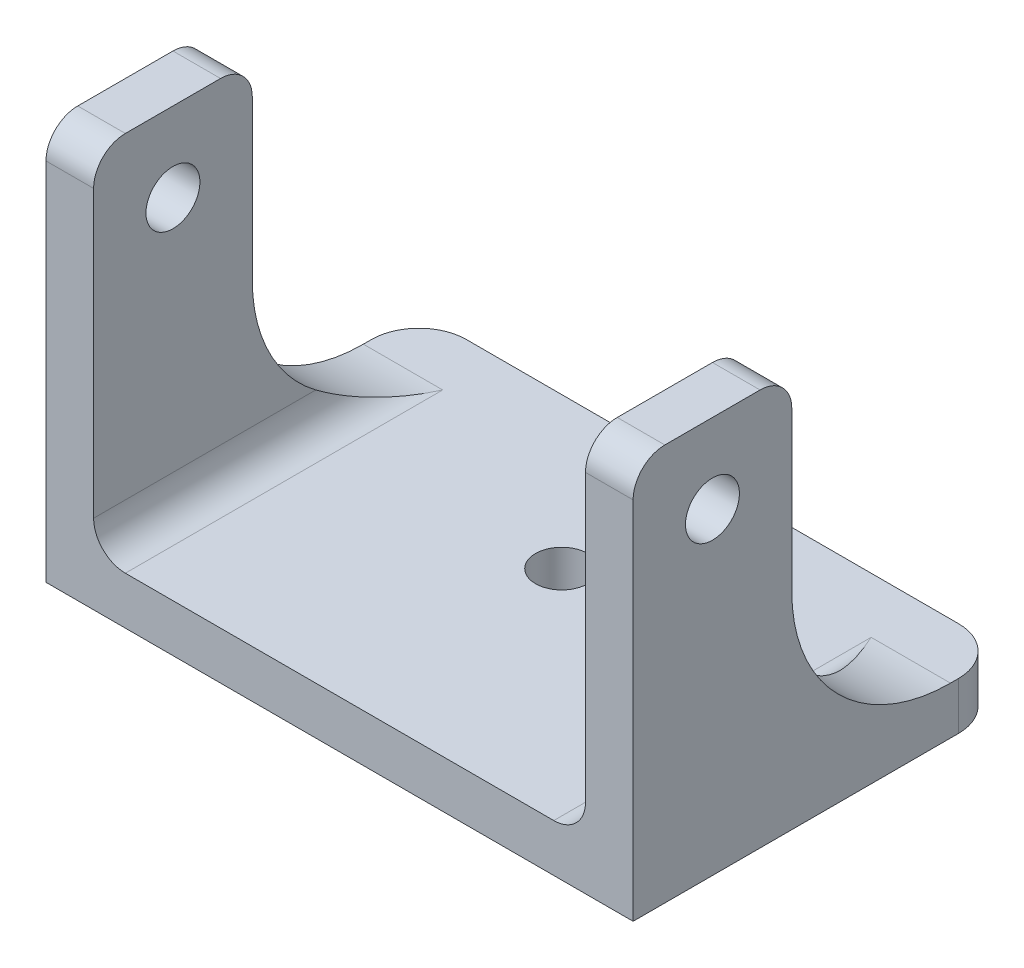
from build123d import *

# Parameters (mm, degrees)
ESQUISSE1_W             = 37
ESQUISSE1_H             = 23.5
BOSS_EXTRU_1_DEPTH      = 3
ESQUISSE2_R             = 7
BOSS_EXTRU_2_DEPTH      = 3
ENL_V_MAT_EXTRU_1_REACH = 25.964
ESQUISSE3_R             = 1.65
ESQUISSE7_W             = 3
ESQUISSE7_H             = 10
BOSS_EXTRU_3_DEPTH      = 22
CONG_2_R                = 3
ESQUISSE8_R             = 1.7
ENL_V_MAT_EXTRU_2_DEPTH = 47.797435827
CONG_3_R                = 2
CONG_4_R                = 10
CONG_5_R                = 2


with BuildPart() as part:
    # Esquisse1 → Boss.-Extru.1 (new body)
    with BuildSketch(Plane(origin=(0, 0, 0), x_dir=(1, 0, 0), z_dir=(0, 1, 0))):
        with Locations((0, -2.25)):
            Rectangle(ESQUISSE1_W, ESQUISSE1_H)
    extrude(amount=BOSS_EXTRU_1_DEPTH)

    # Esquisse2 → Boss.-Extru.2 (add)
    with BuildSketch(Plane.XZ):
        with Locations(Location((0, 0, 0), (0, 0, 90))):
            Circle(ESQUISSE2_R)
    extrude(amount=BOSS_EXTRU_2_DEPTH)

    # Esquisse3 → Enl_v. mat.-Extru.1 (cut, up to next)
    with BuildSketch(Plane.XZ.offset(3), mode=Mode.PRIVATE) as enl_v_mat_extru_1_sk1:
        with Locations(Location((0, 0, 0), (0, 0, 270))):
            Circle(ESQUISSE3_R)
    enl_v_mat_extru_1_tool1 = extrude(enl_v_mat_extru_1_sk1.sketch, amount=-ENL_V_MAT_EXTRU_1_REACH, mode=Mode.PRIVATE) & part.part
    add(enl_v_mat_extru_1_tool1.solids().sort_by_distance((0, -3, 0))[0], mode=Mode.SUBTRACT)

    # Esquisse7 → Boss.-Extru.3 (add)
    with BuildSketch(Plane(origin=(0, 3, 0), x_dir=(1, 0, 0), z_dir=(0, 1, 0))):
        with Locations((-17, -9)):
            Rectangle(ESQUISSE7_W, ESQUISSE7_H)
        with Locations((17, -9)):
            Rectangle(ESQUISSE7_W, ESQUISSE7_H)
    extrude(amount=BOSS_EXTRU_3_DEPTH)

    # Cong_2
    cong_2_edges = [part.edges().sort_by_distance(p)[0] for p in [
        (-18.5, 1.5, -9.5),
        (18.5, 1.5, -9.5),
    ]]
    fillet(cong_2_edges, radius=CONG_2_R)

    # Esquisse8 → Enl_v. mat.-Extru.2 (cut, through all)
    with BuildSketch(Plane.ZY.offset(18.5)):
        with Locations((9, 20)):
            Circle(ESQUISSE8_R)
    extrude(amount=-ENL_V_MAT_EXTRU_2_DEPTH, mode=Mode.SUBTRACT)

    # Cong_3
    cong_3_edges = [part.edges().sort_by_distance(p)[0] for p in [
        (-17, 25, 14),
        (-17, 25, 4),
        (17, 25, 4),
        (17, 25, 14),
    ]]
    fillet(cong_3_edges, radius=CONG_3_R)

    # Cong_4
    cong_4_edges = [part.edges().sort_by_distance(p)[0] for p in [
        (-17, 3, 4),
        (17, 3, 4),
    ]]
    fillet(cong_4_edges, radius=CONG_4_R)

    # Cong_5
    cong_5_edges = [part.edges().sort_by_distance(p)[0] for p in [
        (-15.5, 3, 4),
        (15.5, 3, 4),
    ]]
    fillet(cong_5_edges, radius=CONG_5_R)


solid = part.part
